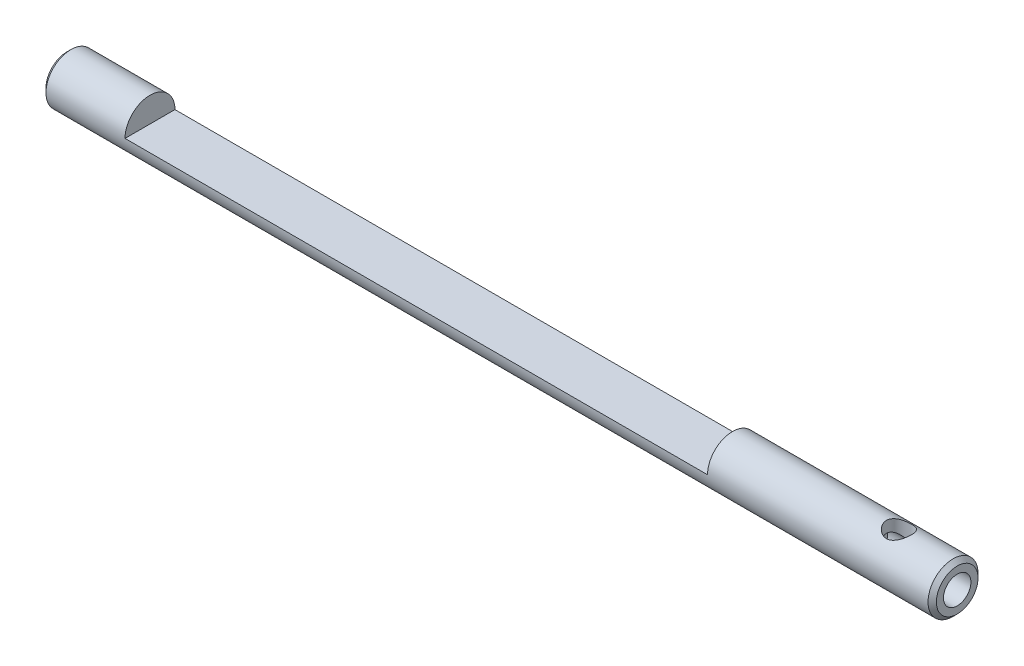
ISO-10303-21;
HEADER;
FILE_DESCRIPTION(('STEP AP214'),'2;1');
FILE_NAME('part.step','',(''),(''),'','','');
FILE_SCHEMA(('AUTOMOTIVE_DESIGN { 1 0 10303 214 1 1 1 1 }'));
ENDSEC;
DATA;
#1=APPLICATION_CONTEXT('core data for automotive mechanical design processes');
#2=APPLICATION_PROTOCOL_DEFINITION('international standard','automotive_design',2000,#1);
#3=PRODUCT_CONTEXT('',#1,'mechanical');
#4=PRODUCT('Part','Part','',(#3));
#5=PRODUCT_RELATED_PRODUCT_CATEGORY('part','',(#4));
#6=PRODUCT_DEFINITION_FORMATION('','',#4);
#7=PRODUCT_DEFINITION_CONTEXT('part definition',#1,'design');
#8=PRODUCT_DEFINITION('design','',#6,#7);
#9=PRODUCT_DEFINITION_SHAPE('','',#8);
#10=(LENGTH_UNIT() NAMED_UNIT(*) SI_UNIT(.MILLI.,.METRE.));
#11=(NAMED_UNIT(*) PLANE_ANGLE_UNIT() SI_UNIT($,.RADIAN.));
#12=(NAMED_UNIT(*) SI_UNIT($,.STERADIAN.) SOLID_ANGLE_UNIT());
#13=UNCERTAINTY_MEASURE_WITH_UNIT(LENGTH_MEASURE(1.E-05),#10,'distance_accuracy_value','');
#14=(GEOMETRIC_REPRESENTATION_CONTEXT(3) GLOBAL_UNCERTAINTY_ASSIGNED_CONTEXT((#13)) GLOBAL_UNIT_ASSIGNED_CONTEXT((#10,
#11,#12)) REPRESENTATION_CONTEXT('',''));
#15=CARTESIAN_POINT('',(0.,0.,0.));
#16=DIRECTION('',(0.,0.,1.));
#17=DIRECTION('',(1.,0.,0.));
#18=AXIS2_PLACEMENT_3D('',#15,#16,#17);
#19=CARTESIAN_POINT('',(17.,0.,0.));
#20=DIRECTION('',(1.,0.,0.));
#21=DIRECTION('',(0.,0.,-1.));
#22=AXIS2_PLACEMENT_3D('',#19,#20,#21);
#23=PLANE('',#22);
#24=CARTESIAN_POINT('',(17.,0.,0.));
#25=DIRECTION('',(1.,0.,0.));
#26=DIRECTION('',(0.,0.,-1.));
#27=AXIS2_PLACEMENT_3D('',#24,#25,#26);
#28=CIRCLE('',#27,1.65);
#29=CARTESIAN_POINT('',(17.,0.,-1.65));
#30=VERTEX_POINT('',#29);
#31=EDGE_CURVE('E131',#30,#30,#28,.T.);
#32=ORIENTED_EDGE('',*,*,#31,.T.);
#33=EDGE_LOOP('',(#32));
#34=FACE_BOUND('',#33,.T.);
#35=ADVANCED_FACE('F17',(#34),#23,.T.);
#36=CARTESIAN_POINT('',(27.,0.,0.));
#37=DIRECTION('',(1.,0.,0.));
#38=DIRECTION('',(0.,0.,-1.));
#39=AXIS2_PLACEMENT_3D('',#36,#37,#38);
#40=PLANE('',#39);
#41=CARTESIAN_POINT('',(27.,0.,0.));
#42=DIRECTION('',(1.,0.,0.));
#43=DIRECTION('',(0.,0.,-1.));
#44=AXIS2_PLACEMENT_3D('',#41,#42,#43);
#45=CIRCLE('',#44,1.65);
#46=CARTESIAN_POINT('',(27.,0.,-1.65));
#47=VERTEX_POINT('',#46);
#48=EDGE_CURVE('E127',#47,#47,#45,.F.);
#49=ORIENTED_EDGE('',*,*,#48,.T.);
#50=EDGE_LOOP('',(#49));
#51=FACE_BOUND('',#50,.T.);
#52=CARTESIAN_POINT('',(27.,0.,0.));
#53=DIRECTION('',(1.,0.,0.));
#54=DIRECTION('',(0.,0.,-1.));
#55=AXIS2_PLACEMENT_3D('',#52,#53,#54);
#56=CIRCLE('',#55,2.49988347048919);
#57=CARTESIAN_POINT('',(27.,0.,-2.49988347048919));
#58=VERTEX_POINT('',#57);
#59=EDGE_CURVE('E63',#58,#58,#56,.F.);
#60=ORIENTED_EDGE('',*,*,#59,.F.);
#61=EDGE_LOOP('',(#60));
#62=FACE_BOUND('',#61,.T.);
#63=ADVANCED_FACE('F148',(#51,#62),#40,.T.);
#64=CARTESIAN_POINT('',(20.,-3.600625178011,0.));
#65=DIRECTION('',(0.,1.,0.));
#66=DIRECTION('',(0.,0.,1.));
#67=AXIS2_PLACEMENT_3D('',#64,#65,#66);
#68=CYLINDRICAL_SURFACE('',#67,1.5);
#69=CARTESIAN_POINT('',(18.5,3.,0.));
#70=CARTESIAN_POINT('',(18.5000039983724,2.99999648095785,-0.078921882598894));
#71=CARTESIAN_POINT('',(18.5062604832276,2.9968547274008,-0.157888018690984));
#72=CARTESIAN_POINT('',(18.5309960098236,2.98460404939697,-0.31344088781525));
#73=CARTESIAN_POINT('',(18.5494874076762,2.97548909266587,-0.390025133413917));
#74=CARTESIAN_POINT('',(18.59778825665,2.95224539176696,-0.538394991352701));
#75=CARTESIAN_POINT('',(18.6275576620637,2.93813439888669,-0.610196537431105));
#76=CARTESIAN_POINT('',(18.6973480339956,2.90619015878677,-0.747695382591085));
#77=CARTESIAN_POINT('',(18.7373702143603,2.88835647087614,-0.813391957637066));
#78=CARTESIAN_POINT('',(18.8292767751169,2.84934349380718,-0.941263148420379));
#79=CARTESIAN_POINT('',(18.881731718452,2.82802717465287,-1.0029852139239));
#80=CARTESIAN_POINT('',(18.9957845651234,2.78489872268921,-1.11717112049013));
#81=CARTESIAN_POINT('',(19.057389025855,2.76308624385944,-1.16962826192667));
#82=CARTESIAN_POINT('',(19.1937248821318,2.7194843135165,-1.26787791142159));
#83=CARTESIAN_POINT('',(19.2691038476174,2.69782789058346,-1.31283782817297));
#84=CARTESIAN_POINT('',(19.4275506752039,2.65928974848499,-1.38925221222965));
#85=CARTESIAN_POINT('',(19.5106130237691,2.64240464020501,-1.42071627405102));
#86=CARTESIAN_POINT('',(19.6769975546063,2.61686802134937,-1.46719863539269));
#87=CARTESIAN_POINT('',(19.7600064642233,2.60778409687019,-1.48308874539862));
#88=CARTESIAN_POINT('',(19.9279680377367,2.59772835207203,-1.50064048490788));
#89=CARTESIAN_POINT('',(20.0129187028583,2.59674853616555,-1.50231613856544));
#90=CARTESIAN_POINT('',(20.171429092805,2.60266395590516,-1.49203092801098));
#91=CARTESIAN_POINT('',(20.2451361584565,2.6086314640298,-1.48167682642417));
#92=CARTESIAN_POINT('',(20.3895829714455,2.62614344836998,-1.45040973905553));
#93=CARTESIAN_POINT('',(20.4603217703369,2.63768969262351,-1.42949340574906));
#94=CARTESIAN_POINT('',(20.5988444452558,2.66531229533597,-1.37731440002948));
#95=CARTESIAN_POINT('',(20.6665210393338,2.68148795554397,-1.34582196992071));
#96=CARTESIAN_POINT('',(20.79595276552,2.71655146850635,-1.27356161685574));
#97=CARTESIAN_POINT('',(20.8577053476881,2.73544048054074,-1.23278972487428));
#98=CARTESIAN_POINT('',(20.9817757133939,2.77669532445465,-1.13710399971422));
#99=CARTESIAN_POINT('',(21.0431737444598,2.79919844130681,-1.08105287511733));
#100=CARTESIAN_POINT('',(21.1560935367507,2.84321031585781,-0.959344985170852));
#101=CARTESIAN_POINT('',(21.207608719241,2.86471840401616,-0.893681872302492));
#102=CARTESIAN_POINT('',(21.3015551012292,2.90554148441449,-0.750736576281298));
#103=CARTESIAN_POINT('',(21.3434466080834,2.9247062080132,-0.673053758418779));
#104=CARTESIAN_POINT('',(21.4131779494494,2.95738347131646,-0.510593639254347));
#105=CARTESIAN_POINT('',(21.4410445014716,2.97090674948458,-0.425830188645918));
#106=CARTESIAN_POINT('',(21.4740383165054,2.98708428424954,-0.283628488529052));
#107=CARTESIAN_POINT('',(21.4837494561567,2.99190265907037,-0.22746049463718));
#108=CARTESIAN_POINT('',(21.4967314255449,2.99836163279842,-0.114202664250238));
#109=CARTESIAN_POINT('',(21.5000028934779,3.00000254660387,-0.0571129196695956));
#110=CARTESIAN_POINT('',(21.4999960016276,2.99999648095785,0.0789218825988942));
#111=CARTESIAN_POINT('',(21.4937395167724,2.9968547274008,0.157888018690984));
#112=CARTESIAN_POINT('',(21.4690039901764,2.98460404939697,0.31344088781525));
#113=CARTESIAN_POINT('',(21.4505125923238,2.97548909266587,0.390025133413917));
#114=CARTESIAN_POINT('',(21.40221174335,2.95224539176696,0.5383949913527));
#115=CARTESIAN_POINT('',(21.3724423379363,2.93813439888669,0.610196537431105));
#116=CARTESIAN_POINT('',(21.3026519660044,2.90619015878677,0.747695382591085));
#117=CARTESIAN_POINT('',(21.2626297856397,2.88835647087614,0.813391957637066));
#118=CARTESIAN_POINT('',(21.1707232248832,2.84934349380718,0.941263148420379));
#119=CARTESIAN_POINT('',(21.118268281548,2.82802717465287,1.0029852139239));
#120=CARTESIAN_POINT('',(21.0042154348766,2.78489872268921,1.11717112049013));
#121=CARTESIAN_POINT('',(20.942610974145,2.76308624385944,1.16962826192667));
#122=CARTESIAN_POINT('',(20.8062751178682,2.7194843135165,1.26787791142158));
#123=CARTESIAN_POINT('',(20.7308961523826,2.69782789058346,1.31283782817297));
#124=CARTESIAN_POINT('',(20.5724493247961,2.65928974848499,1.38925221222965));
#125=CARTESIAN_POINT('',(20.4893869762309,2.64240464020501,1.42071627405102));
#126=CARTESIAN_POINT('',(20.3230024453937,2.61686802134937,1.46719863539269));
#127=CARTESIAN_POINT('',(20.2399935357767,2.60778409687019,1.48308874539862));
#128=CARTESIAN_POINT('',(20.0720319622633,2.59772835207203,1.50064048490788));
#129=CARTESIAN_POINT('',(19.9870812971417,2.59674853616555,1.50231613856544));
#130=CARTESIAN_POINT('',(19.828570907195,2.60266395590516,1.49203092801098));
#131=CARTESIAN_POINT('',(19.7548638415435,2.6086314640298,1.48167682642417));
#132=CARTESIAN_POINT('',(19.6104170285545,2.62614344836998,1.45040973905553));
#133=CARTESIAN_POINT('',(19.5396782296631,2.63768969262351,1.42949340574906));
#134=CARTESIAN_POINT('',(19.4011555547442,2.66531229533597,1.37731440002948));
#135=CARTESIAN_POINT('',(19.3334789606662,2.68148795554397,1.34582196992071));
#136=CARTESIAN_POINT('',(19.20404723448,2.71655146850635,1.27356161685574));
#137=CARTESIAN_POINT('',(19.1422946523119,2.73544048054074,1.23278972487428));
#138=CARTESIAN_POINT('',(19.0182242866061,2.77669532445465,1.13710399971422));
#139=CARTESIAN_POINT('',(18.9568262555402,2.79919844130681,1.08105287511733));
#140=CARTESIAN_POINT('',(18.8439064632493,2.84321031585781,0.959344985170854));
#141=CARTESIAN_POINT('',(18.792391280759,2.86471840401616,0.893681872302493));
#142=CARTESIAN_POINT('',(18.6984448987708,2.90554148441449,0.750736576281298));
#143=CARTESIAN_POINT('',(18.6565533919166,2.9247062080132,0.67305375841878));
#144=CARTESIAN_POINT('',(18.5868220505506,2.95738347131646,0.510593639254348));
#145=CARTESIAN_POINT('',(18.5589554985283,2.97090674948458,0.42583018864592));
#146=CARTESIAN_POINT('',(18.5259616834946,2.98708428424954,0.283628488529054));
#147=CARTESIAN_POINT('',(18.5162505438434,2.99190265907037,0.227460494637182));
#148=CARTESIAN_POINT('',(18.5032685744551,2.99836163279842,0.114202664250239));
#149=CARTESIAN_POINT('',(18.4999971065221,3.00000254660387,0.0571129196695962));
#150=CARTESIAN_POINT('',(18.5,3.,0.));
#151=B_SPLINE_CURVE_WITH_KNOTS('',3,(#69,#70,#71,#72,#73,#74,#75,#76,#77,#78,#79,#80,#81,#82,
#83,#84,#85,#86,#87,#88,#89,#90,#91,#92,#93,#94,#95,#96,#97,#98,#99,#100,#101,#102,#103,#104,
#105,#106,#107,#108,#109,#110,#111,#112,#113,#114,#115,#116,#117,#118,#119,#120,#121,#122,#123,
#124,#125,#126,#127,#128,#129,#130,#131,#132,#133,#134,#135,#136,#137,#138,#139,#140,#141,#142,
#143,#144,#145,#146,#147,#148,#149,#150),.UNSPECIFIED.,.T.,.F.,(4,2,2,2,2,2,2,2,2,2,2,2,2,2,2,2,
2,2,2,2,2,2,2,2,2,2,2,2,2,2,2,2,2,2,2,2,2,2,2,2,4),(0.,0.23654148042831,0.473322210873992,
0.709269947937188,0.945245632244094,1.19547738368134,1.4458893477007,1.71572535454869,
1.98536920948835,2.23886984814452,2.49212035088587,2.71508584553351,2.93812204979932,
3.16635602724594,3.39468780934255,3.65195007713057,3.90938300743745,4.17889584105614,
4.44789329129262,4.61908679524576,4.79026333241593,5.02680481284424,5.26358554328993,
5.49953328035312,5.73550896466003,5.98574071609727,6.23615268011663,6.50598868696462,
6.77563254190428,7.02913318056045,7.2823836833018,7.50534917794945,7.72838538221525,
7.95661935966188,8.18495114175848,8.4422134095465,8.69964633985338,8.96915917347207,
9.23815662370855,9.4093501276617,9.58052666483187),.UNSPECIFIED.);
#152=CARTESIAN_POINT('',(18.5,3.,0.));
#153=VERTEX_POINT('',#152);
#154=EDGE_CURVE('E62',#153,#153,#151,.T.);
#155=ORIENTED_EDGE('',*,*,#154,.F.);
#156=EDGE_LOOP('',(#155));
#157=FACE_BOUND('',#156,.T.);
#158=CARTESIAN_POINT('',(21.5,1.65,0.));
#159=CARTESIAN_POINT('',(21.4999954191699,1.64999547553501,-0.0692818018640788));
#160=CARTESIAN_POINT('',(21.4951613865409,1.64559748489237,-0.138601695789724));
#161=CARTESIAN_POINT('',(21.4762048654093,1.62839356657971,-0.274898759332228));
#162=CARTESIAN_POINT('',(21.4620729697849,1.61557912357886,-0.341873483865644));
#163=CARTESIAN_POINT('',(21.4256586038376,1.58270067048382,-0.471149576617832));
#164=CARTESIAN_POINT('',(21.4034288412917,1.56268355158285,-0.533478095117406));
#165=CARTESIAN_POINT('',(21.352056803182,1.5167159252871,-0.652818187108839));
#166=CARTESIAN_POINT('',(21.322911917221,1.49076317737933,-0.709827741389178));
#167=CARTESIAN_POINT('',(21.2461003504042,1.42296017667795,-0.839625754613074));
#168=CARTESIAN_POINT('',(21.1956838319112,1.37889899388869,-0.909631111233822));
#169=CARTESIAN_POINT('',(21.0861021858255,1.28503558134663,-1.0380476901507));
#170=CARTESIAN_POINT('',(21.0269159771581,1.23521958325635,-1.09643015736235));
#171=CARTESIAN_POINT('',(20.8997469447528,1.13164064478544,-1.20312945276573));
#172=CARTESIAN_POINT('',(20.83158694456,1.07781163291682,-1.25117075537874));
#173=CARTESIAN_POINT('',(20.7238007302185,0.997909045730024,-1.3144726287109));
#174=CARTESIAN_POINT('',(20.6869687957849,0.971428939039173,-1.33410507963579));
#175=CARTESIAN_POINT('',(20.6112501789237,0.919436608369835,-1.37045172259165));
#176=CARTESIAN_POINT('',(20.5723647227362,0.893923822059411,-1.38716763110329));
#177=CARTESIAN_POINT('',(20.4927929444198,0.845202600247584,-1.41737145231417));
#178=CARTESIAN_POINT('',(20.4521396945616,0.821966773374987,-1.43090150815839));
#179=CARTESIAN_POINT('',(20.3681192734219,0.778915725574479,-1.45478302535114));
#180=CARTESIAN_POINT('',(20.3247534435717,0.759098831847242,-1.46513604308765));
#181=CARTESIAN_POINT('',(20.2426535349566,0.728146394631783,-1.48072726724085));
#182=CARTESIAN_POINT('',(20.204381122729,0.716108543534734,-1.48653512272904));
#183=CARTESIAN_POINT('',(20.1261938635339,0.697850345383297,-1.49519595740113));
#184=CARTESIAN_POINT('',(20.0862846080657,0.691611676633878,-1.49805824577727));
#185=CARTESIAN_POINT('',(20.0055274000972,0.686223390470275,-1.50053652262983));
#186=CARTESIAN_POINT('',(19.9646744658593,0.687131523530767,-1.50012606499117));
#187=CARTESIAN_POINT('',(19.8838714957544,0.69595859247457,-1.49604844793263));
#188=CARTESIAN_POINT('',(19.8439236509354,0.70389299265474,-1.4923741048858));
#189=CARTESIAN_POINT('',(19.7522978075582,0.728886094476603,-1.48036142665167));
#190=CARTESIAN_POINT('',(19.7014116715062,0.74816717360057,-1.47084031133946));
#191=CARTESIAN_POINT('',(19.6032194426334,0.792461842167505,-1.44745752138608));
#192=CARTESIAN_POINT('',(19.5559287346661,0.817498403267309,-1.43357836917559));
#193=CARTESIAN_POINT('',(19.4659831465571,0.869704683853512,-1.40250106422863));
#194=CARTESIAN_POINT('',(19.4232267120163,0.896776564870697,-1.38542775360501));
#195=CARTESIAN_POINT('',(19.3401823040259,0.952319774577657,-1.34785648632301));
#196=CARTESIAN_POINT('',(19.2998963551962,0.980792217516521,-1.32735577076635));
#197=CARTESIAN_POINT('',(19.18227493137,1.06690097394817,-1.26074195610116));
#198=CARTESIAN_POINT('',(19.1082257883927,1.12519685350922,-1.20953484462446));
#199=CARTESIAN_POINT('',(18.9649433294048,1.24180087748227,-1.08988887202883));
#200=CARTESIAN_POINT('',(18.8962372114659,1.29991424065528,-1.02062385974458));
#201=CARTESIAN_POINT('',(18.7713113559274,1.4075439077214,-0.866085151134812));
#202=CARTESIAN_POINT('',(18.7150438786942,1.45709291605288,-0.780875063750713));
#203=CARTESIAN_POINT('',(18.6374334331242,1.5260763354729,-0.630570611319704));
#204=CARTESIAN_POINT('',(18.610935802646,1.54980747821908,-0.570088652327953));
#205=CARTESIAN_POINT('',(18.5657112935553,1.5904666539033,-0.444149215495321));
#206=CARTESIAN_POINT('',(18.5469714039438,1.60740607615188,-0.378700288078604));
#207=CARTESIAN_POINT('',(18.5219674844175,1.63004916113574,-0.260959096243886));
#208=CARTESIAN_POINT('',(18.513765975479,1.63749392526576,-0.209405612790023));
#209=CARTESIAN_POINT('',(18.5027801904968,1.64747133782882,-0.105242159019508));
#210=CARTESIAN_POINT('',(18.4999965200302,1.65000343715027,-0.0526320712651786));
#211=CARTESIAN_POINT('',(18.5000045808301,1.64999547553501,0.0692818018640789));
#212=CARTESIAN_POINT('',(18.5048386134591,1.64559748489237,0.138601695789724));
#213=CARTESIAN_POINT('',(18.5237951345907,1.62839356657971,0.274898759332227));
#214=CARTESIAN_POINT('',(18.5379270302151,1.61557912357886,0.341873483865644));
#215=CARTESIAN_POINT('',(18.5743413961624,1.58270067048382,0.471149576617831));
#216=CARTESIAN_POINT('',(18.5965711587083,1.56268355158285,0.533478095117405));
#217=CARTESIAN_POINT('',(18.647943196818,1.5167159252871,0.652818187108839));
#218=CARTESIAN_POINT('',(18.677088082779,1.49076317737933,0.709827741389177));
#219=CARTESIAN_POINT('',(18.7538996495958,1.42296017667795,0.839625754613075));
#220=CARTESIAN_POINT('',(18.8043161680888,1.37889899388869,0.909631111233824));
#221=CARTESIAN_POINT('',(18.9138978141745,1.28503558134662,1.0380476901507));
#222=CARTESIAN_POINT('',(18.973084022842,1.23521958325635,1.09643015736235));
#223=CARTESIAN_POINT('',(19.1002530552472,1.13164064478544,1.20312945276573));
#224=CARTESIAN_POINT('',(19.16841305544,1.07781163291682,1.25117075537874));
#225=CARTESIAN_POINT('',(19.2761992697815,0.997909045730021,1.3144726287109));
#226=CARTESIAN_POINT('',(19.3130312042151,0.971428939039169,1.33410507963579));
#227=CARTESIAN_POINT('',(19.3887498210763,0.919436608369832,1.37045172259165));
#228=CARTESIAN_POINT('',(19.4276352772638,0.893923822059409,1.38716763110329));
#229=CARTESIAN_POINT('',(19.5072070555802,0.845202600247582,1.41737145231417));
#230=CARTESIAN_POINT('',(19.5478603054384,0.821966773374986,1.43090150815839));
#231=CARTESIAN_POINT('',(19.6318807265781,0.778915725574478,1.45478302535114));
#232=CARTESIAN_POINT('',(19.6752465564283,0.759098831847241,1.46513604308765));
#233=CARTESIAN_POINT('',(19.7573464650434,0.728146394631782,1.48072726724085));
#234=CARTESIAN_POINT('',(19.795618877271,0.716108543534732,1.48653512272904));
#235=CARTESIAN_POINT('',(19.8738061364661,0.697850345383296,1.49519595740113));
#236=CARTESIAN_POINT('',(19.9137153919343,0.691611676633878,1.49805824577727));
#237=CARTESIAN_POINT('',(19.9944725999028,0.686223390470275,1.50053652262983));
#238=CARTESIAN_POINT('',(20.0353255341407,0.687131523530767,1.50012606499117));
#239=CARTESIAN_POINT('',(20.1161285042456,0.69595859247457,1.49604844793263));
#240=CARTESIAN_POINT('',(20.1560763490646,0.70389299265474,1.4923741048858));
#241=CARTESIAN_POINT('',(20.2477021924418,0.728886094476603,1.48036142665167));
#242=CARTESIAN_POINT('',(20.2985883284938,0.748167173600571,1.47084031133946));
#243=CARTESIAN_POINT('',(20.3967805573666,0.792461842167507,1.44745752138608));
#244=CARTESIAN_POINT('',(20.4440712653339,0.817498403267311,1.43357836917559));
#245=CARTESIAN_POINT('',(20.5340168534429,0.869704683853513,1.40250106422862));
#246=CARTESIAN_POINT('',(20.5767732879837,0.896776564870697,1.38542775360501));
#247=CARTESIAN_POINT('',(20.6598176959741,0.952319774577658,1.34785648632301));
#248=CARTESIAN_POINT('',(20.7001036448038,0.980792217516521,1.32735577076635));
#249=CARTESIAN_POINT('',(20.81772506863,1.06690097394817,1.26074195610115));
#250=CARTESIAN_POINT('',(20.8917742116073,1.12519685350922,1.20953484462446));
#251=CARTESIAN_POINT('',(21.0350566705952,1.24180087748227,1.08988887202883));
#252=CARTESIAN_POINT('',(21.1037627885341,1.29991424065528,1.02062385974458));
#253=CARTESIAN_POINT('',(21.2286886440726,1.4075439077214,0.866085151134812));
#254=CARTESIAN_POINT('',(21.2849561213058,1.45709291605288,0.780875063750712));
#255=CARTESIAN_POINT('',(21.3625665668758,1.5260763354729,0.630570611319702));
#256=CARTESIAN_POINT('',(21.389064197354,1.54980747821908,0.570088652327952));
#257=CARTESIAN_POINT('',(21.4342887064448,1.5904666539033,0.44414921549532));
#258=CARTESIAN_POINT('',(21.4530285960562,1.60740607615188,0.378700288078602));
#259=CARTESIAN_POINT('',(21.4780325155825,1.63004916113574,0.260959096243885));
#260=CARTESIAN_POINT('',(21.486234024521,1.63749392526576,0.209405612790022));
#261=CARTESIAN_POINT('',(21.4972198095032,1.64747133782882,0.105242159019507));
#262=CARTESIAN_POINT('',(21.5000034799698,1.65000343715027,0.0526320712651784));
#263=CARTESIAN_POINT('',(21.5,1.65,0.));
#264=B_SPLINE_CURVE_WITH_KNOTS('',3,(#158,#159,#160,#161,#162,#163,#164,#165,#166,#167,#168,
#169,#170,#171,#172,#173,#174,#175,#176,#177,#178,#179,#180,#181,#182,#183,#184,#185,#186,#187,
#188,#189,#190,#191,#192,#193,#194,#195,#196,#197,#198,#199,#200,#201,#202,#203,#204,#205,#206,
#207,#208,#209,#210,#211,#212,#213,#214,#215,#216,#217,#218,#219,#220,#221,#222,#223,#224,#225,
#226,#227,#228,#229,#230,#231,#232,#233,#234,#235,#236,#237,#238,#239,#240,#241,#242,#243,#244,
#245,#246,#247,#248,#249,#250,#251,#252,#253,#254,#255,#256,#257,#258,#259,#260,#261,#262,#263),
.UNSPECIFIED.,.T.,.F.,(4,2,2,2,2,2,2,2,2,2,2,2,2,2,2,2,2,2,2,2,2,2,2,2,2,2,2,2,2,2,2,2,2,2,2,2,
2,2,2,2,2,2,2,2,2,2,2,2,2,2,2,2,4),(0.,0.207617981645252,0.415446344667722,0.621945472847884,
0.828522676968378,1.11754439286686,1.40727249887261,1.70396132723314,1.852147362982,
2.00024589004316,2.1462588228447,2.29220011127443,2.41339222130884,2.53420012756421,
2.65598523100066,2.778039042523,2.9428402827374,3.10831107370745,3.2683134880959,
3.42844532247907,3.74889242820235,4.08789625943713,4.42557548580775,4.63530008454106,
4.84467150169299,5.00237731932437,5.16010076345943,5.36771874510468,5.57554710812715,
5.78204623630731,5.98862344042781,6.27764515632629,6.56737326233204,6.86406209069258,
7.01224812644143,7.16034665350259,7.30635958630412,7.45230087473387,7.57349298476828,
7.69430089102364,7.81608599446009,7.93813980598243,8.10294104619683,8.26841183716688,
8.42841425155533,8.5885460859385,8.90899319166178,9.24799702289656,9.58567624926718,
9.79540084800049,10.0047722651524,10.1624780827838,10.3202015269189),.UNSPECIFIED.);
#265=CARTESIAN_POINT('',(21.5,1.65,0.));
#266=VERTEX_POINT('',#265);
#267=EDGE_CURVE('E22',#266,#266,#264,.T.);
#268=ORIENTED_EDGE('',*,*,#267,.F.);
#269=EDGE_LOOP('',(#268));
#270=FACE_BOUND('',#269,.T.);
#271=ADVANCED_FACE('F142',(#157,#270),#68,.F.);
#272=CARTESIAN_POINT('',(-80.,0.,0.));
#273=DIRECTION('',(1.,0.,0.));
#274=DIRECTION('',(0.,0.,-1.));
#275=AXIS2_PLACEMENT_3D('',#272,#273,#274);
#276=PLANE('',#275);
#277=CARTESIAN_POINT('',(-80.,0.,0.));
#278=DIRECTION('',(1.,0.,0.));
#279=DIRECTION('',(0.,0.,-1.));
#280=AXIS2_PLACEMENT_3D('',#277,#278,#279);
#281=CIRCLE('',#280,2.49988347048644);
#282=CARTESIAN_POINT('',(-80.,0.,-2.49988347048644));
#283=VERTEX_POINT('',#282);
#284=EDGE_CURVE('E141',#283,#283,#281,.T.);
#285=ORIENTED_EDGE('',*,*,#284,.F.);
#286=EDGE_LOOP('',(#285));
#287=FACE_BOUND('',#286,.T.);
#288=ADVANCED_FACE('F147',(#287),#276,.F.);
#289=CARTESIAN_POINT('',(0.,0.,0.));
#290=DIRECTION('',(1.,0.,0.));
#291=DIRECTION('',(0.,0.,-1.));
#292=AXIS2_PLACEMENT_3D('',#289,#290,#291);
#293=PLANE('',#292);
#294=CARTESIAN_POINT('',(0.,0.,0.));
#295=DIRECTION('',(1.,0.,0.));
#296=DIRECTION('',(0.,0.,-1.));
#297=AXIS2_PLACEMENT_3D('',#294,#295,#296);
#298=CIRCLE('',#297,3.);
#299=CARTESIAN_POINT('',(0.,0.,-3.));
#300=VERTEX_POINT('',#299);
#301=CARTESIAN_POINT('',(0.,9.93800260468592E-09,3.));
#302=VERTEX_POINT('',#301);
#303=EDGE_CURVE('E48',#300,#302,#298,.T.);
#304=ORIENTED_EDGE('',*,*,#303,.F.);
#305=DIRECTION('',(0.,0.,-1.));
#306=VECTOR('',#305,1.);
#307=CARTESIAN_POINT('',(0.,0.,3.));
#308=LINE('',#307,#306);
#309=EDGE_CURVE('E50',#300,#302,#308,.F.);
#310=ORIENTED_EDGE('',*,*,#309,.T.);
#311=EDGE_LOOP('',(#304,#310));
#312=FACE_BOUND('',#311,.T.);
#313=ADVANCED_FACE('F51',(#312),#293,.F.);
#314=CARTESIAN_POINT('',(-70.,0.,0.));
#315=DIRECTION('',(1.,0.,0.));
#316=DIRECTION('',(0.,0.,-1.));
#317=AXIS2_PLACEMENT_3D('',#314,#315,#316);
#318=PLANE('',#317);
#319=DIRECTION('',(0.,0.,-1.));
#320=VECTOR('',#319,1.);
#321=CARTESIAN_POINT('',(-70.,0.,3.));
#322=LINE('',#321,#320);
#323=CARTESIAN_POINT('',(-70.,0.,3.));
#324=VERTEX_POINT('',#323);
#325=CARTESIAN_POINT('',(-70.,0.,-3.));
#326=VERTEX_POINT('',#325);
#327=EDGE_CURVE('E40',#324,#326,#322,.T.);
#328=ORIENTED_EDGE('',*,*,#327,.T.);
#329=CARTESIAN_POINT('',(-70.,0.,0.));
#330=DIRECTION('',(1.,0.,0.));
#331=DIRECTION('',(0.,0.,-1.));
#332=AXIS2_PLACEMENT_3D('',#329,#330,#331);
#333=CIRCLE('',#332,3.);
#334=EDGE_CURVE('E56',#324,#326,#333,.F.);
#335=ORIENTED_EDGE('',*,*,#334,.F.);
#336=EDGE_LOOP('',(#328,#335));
#337=FACE_BOUND('',#336,.T.);
#338=ADVANCED_FACE('F97',(#337),#318,.T.);
#339=CARTESIAN_POINT('',(27.,0.,0.));
#340=DIRECTION('',(1.,0.,0.));
#341=DIRECTION('',(0.,0.,-1.));
#342=AXIS2_PLACEMENT_3D('',#339,#340,#341);
#343=CYLINDRICAL_SURFACE('',#342,1.65);
#344=ORIENTED_EDGE('',*,*,#31,.F.);
#345=EDGE_LOOP('',(#344));
#346=FACE_BOUND('',#345,.T.);
#347=CARTESIAN_POINT('',(18.5,-1.65,0.));
#348=CARTESIAN_POINT('',(18.5000045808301,-1.64999547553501,-0.0692818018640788));
#349=CARTESIAN_POINT('',(18.5048386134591,-1.64559748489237,-0.138601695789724));
#350=CARTESIAN_POINT('',(18.5237951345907,-1.62839356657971,-0.274898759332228));
#351=CARTESIAN_POINT('',(18.5379270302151,-1.61557912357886,-0.341873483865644));
#352=CARTESIAN_POINT('',(18.5743413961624,-1.58270067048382,-0.471149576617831));
#353=CARTESIAN_POINT('',(18.5965711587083,-1.56268355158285,-0.533478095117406));
#354=CARTESIAN_POINT('',(18.647943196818,-1.5167159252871,-0.652818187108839));
#355=CARTESIAN_POINT('',(18.677088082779,-1.49076317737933,-0.709827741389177));
#356=CARTESIAN_POINT('',(18.7538996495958,-1.42296017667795,-0.839625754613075));
#357=CARTESIAN_POINT('',(18.8043161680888,-1.37889899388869,-0.909631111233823));
#358=CARTESIAN_POINT('',(18.9138978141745,-1.28503558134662,-1.0380476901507));
#359=CARTESIAN_POINT('',(18.973084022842,-1.23521958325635,-1.09643015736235));
#360=CARTESIAN_POINT('',(19.1002530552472,-1.13164064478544,-1.20312945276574));
#361=CARTESIAN_POINT('',(19.16841305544,-1.07781163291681,-1.25117075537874));
#362=CARTESIAN_POINT('',(19.2761992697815,-0.997909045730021,-1.3144726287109));
#363=CARTESIAN_POINT('',(19.3130312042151,-0.97142893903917,-1.33410507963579));
#364=CARTESIAN_POINT('',(19.3887498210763,-0.919436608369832,-1.37045172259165));
#365=CARTESIAN_POINT('',(19.4276352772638,-0.893923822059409,-1.38716763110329));
#366=CARTESIAN_POINT('',(19.5072070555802,-0.845202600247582,-1.41737145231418));
#367=CARTESIAN_POINT('',(19.5478603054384,-0.821966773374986,-1.43090150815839));
#368=CARTESIAN_POINT('',(19.6318807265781,-0.778915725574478,-1.45478302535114));
#369=CARTESIAN_POINT('',(19.6752465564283,-0.759098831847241,-1.46513604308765));
#370=CARTESIAN_POINT('',(19.7573464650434,-0.728146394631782,-1.48072726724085));
#371=CARTESIAN_POINT('',(19.795618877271,-0.716108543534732,-1.48653512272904));
#372=CARTESIAN_POINT('',(19.8738061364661,-0.697850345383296,-1.49519595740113));
#373=CARTESIAN_POINT('',(19.9137153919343,-0.691611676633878,-1.49805824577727));
#374=CARTESIAN_POINT('',(19.9944725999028,-0.686223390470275,-1.50053652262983));
#375=CARTESIAN_POINT('',(20.0353255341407,-0.687131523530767,-1.50012606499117));
#376=CARTESIAN_POINT('',(20.1161285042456,-0.69595859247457,-1.49604844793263));
#377=CARTESIAN_POINT('',(20.1560763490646,-0.70389299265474,-1.4923741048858));
#378=CARTESIAN_POINT('',(20.2477021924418,-0.728886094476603,-1.48036142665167));
#379=CARTESIAN_POINT('',(20.2985883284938,-0.748167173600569,-1.47084031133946));
#380=CARTESIAN_POINT('',(20.3967805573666,-0.792461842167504,-1.44745752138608));
#381=CARTESIAN_POINT('',(20.4440712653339,-0.817498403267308,-1.43357836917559));
#382=CARTESIAN_POINT('',(20.5340168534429,-0.869704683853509,-1.40250106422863));
#383=CARTESIAN_POINT('',(20.5767732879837,-0.896776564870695,-1.38542775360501));
#384=CARTESIAN_POINT('',(20.6598176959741,-0.952319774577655,-1.34785648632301));
#385=CARTESIAN_POINT('',(20.7001036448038,-0.980792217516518,-1.32735577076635));
#386=CARTESIAN_POINT('',(20.81772506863,-1.06690097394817,-1.26074195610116));
#387=CARTESIAN_POINT('',(20.8917742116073,-1.12519685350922,-1.20953484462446));
#388=CARTESIAN_POINT('',(21.0350566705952,-1.24180087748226,-1.08988887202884));
#389=CARTESIAN_POINT('',(21.1037627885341,-1.29991424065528,-1.02062385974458));
#390=CARTESIAN_POINT('',(21.2286886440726,-1.4075439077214,-0.866085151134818));
#391=CARTESIAN_POINT('',(21.2849561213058,-1.45709291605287,-0.78087506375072));
#392=CARTESIAN_POINT('',(21.3625665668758,-1.52607633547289,-0.630570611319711));
#393=CARTESIAN_POINT('',(21.389064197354,-1.54980747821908,-0.570088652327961));
#394=CARTESIAN_POINT('',(21.4342887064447,-1.59046665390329,-0.444149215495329));
#395=CARTESIAN_POINT('',(21.4530285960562,-1.60740607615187,-0.378700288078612));
#396=CARTESIAN_POINT('',(21.4780325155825,-1.63004916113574,-0.260959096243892));
#397=CARTESIAN_POINT('',(21.486234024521,-1.63749392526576,-0.209405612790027));
#398=CARTESIAN_POINT('',(21.4972198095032,-1.64747133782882,-0.10524215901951));
#399=CARTESIAN_POINT('',(21.5000034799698,-1.65000343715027,-0.0526320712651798));
#400=CARTESIAN_POINT('',(21.4999954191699,-1.64999547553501,0.0692818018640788));
#401=CARTESIAN_POINT('',(21.4951613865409,-1.64559748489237,0.138601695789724));
#402=CARTESIAN_POINT('',(21.4762048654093,-1.62839356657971,0.274898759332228));
#403=CARTESIAN_POINT('',(21.4620729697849,-1.61557912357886,0.341873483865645));
#404=CARTESIAN_POINT('',(21.4256586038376,-1.58270067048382,0.471149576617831));
#405=CARTESIAN_POINT('',(21.4034288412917,-1.56268355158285,0.533478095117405));
#406=CARTESIAN_POINT('',(21.352056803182,-1.5167159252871,0.652818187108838));
#407=CARTESIAN_POINT('',(21.322911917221,-1.49076317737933,0.709827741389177));
#408=CARTESIAN_POINT('',(21.2461003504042,-1.42296017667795,0.839625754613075));
#409=CARTESIAN_POINT('',(21.1956838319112,-1.37889899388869,0.909631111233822));
#410=CARTESIAN_POINT('',(21.0861021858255,-1.28503558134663,1.0380476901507));
#411=CARTESIAN_POINT('',(21.0269159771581,-1.23521958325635,1.09643015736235));
#412=CARTESIAN_POINT('',(20.8997469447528,-1.13164064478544,1.20312945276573));
#413=CARTESIAN_POINT('',(20.83158694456,-1.07781163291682,1.25117075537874));
#414=CARTESIAN_POINT('',(20.7238007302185,-0.997909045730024,1.3144726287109));
#415=CARTESIAN_POINT('',(20.6869687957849,-0.971428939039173,1.33410507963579));
#416=CARTESIAN_POINT('',(20.6112501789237,-0.919436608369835,1.37045172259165));
#417=CARTESIAN_POINT('',(20.5723647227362,-0.893923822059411,1.38716763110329));
#418=CARTESIAN_POINT('',(20.4927929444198,-0.845202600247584,1.41737145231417));
#419=CARTESIAN_POINT('',(20.4521396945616,-0.821966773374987,1.43090150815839));
#420=CARTESIAN_POINT('',(20.3681192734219,-0.778915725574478,1.45478302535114));
#421=CARTESIAN_POINT('',(20.3247534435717,-0.759098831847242,1.46513604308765));
#422=CARTESIAN_POINT('',(20.2426535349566,-0.728146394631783,1.48072726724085));
#423=CARTESIAN_POINT('',(20.204381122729,-0.716108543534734,1.48653512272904));
#424=CARTESIAN_POINT('',(20.1261938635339,-0.697850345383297,1.49519595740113));
#425=CARTESIAN_POINT('',(20.0862846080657,-0.691611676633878,1.49805824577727));
#426=CARTESIAN_POINT('',(20.0055274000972,-0.686223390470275,1.50053652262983));
#427=CARTESIAN_POINT('',(19.9646744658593,-0.687131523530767,1.50012606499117));
#428=CARTESIAN_POINT('',(19.8838714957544,-0.69595859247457,1.49604844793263));
#429=CARTESIAN_POINT('',(19.8439236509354,-0.70389299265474,1.4923741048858));
#430=CARTESIAN_POINT('',(19.7522978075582,-0.728886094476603,1.48036142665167));
#431=CARTESIAN_POINT('',(19.7014116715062,-0.74816717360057,1.47084031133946));
#432=CARTESIAN_POINT('',(19.6032194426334,-0.792461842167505,1.44745752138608));
#433=CARTESIAN_POINT('',(19.5559287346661,-0.81749840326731,1.43357836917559));
#434=CARTESIAN_POINT('',(19.4659831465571,-0.869704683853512,1.40250106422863));
#435=CARTESIAN_POINT('',(19.4232267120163,-0.896776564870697,1.38542775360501));
#436=CARTESIAN_POINT('',(19.3401823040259,-0.952319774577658,1.34785648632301));
#437=CARTESIAN_POINT('',(19.2998963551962,-0.980792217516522,1.32735577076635));
#438=CARTESIAN_POINT('',(19.18227493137,-1.06690097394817,1.26074195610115));
#439=CARTESIAN_POINT('',(19.1082257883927,-1.12519685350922,1.20953484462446));
#440=CARTESIAN_POINT('',(18.9649433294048,-1.24180087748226,1.08988887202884));
#441=CARTESIAN_POINT('',(18.8962372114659,-1.29991424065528,1.02062385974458));
#442=CARTESIAN_POINT('',(18.7713113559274,-1.4075439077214,0.866085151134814));
#443=CARTESIAN_POINT('',(18.7150438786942,-1.45709291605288,0.780875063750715));
#444=CARTESIAN_POINT('',(18.6374334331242,-1.52607633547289,0.630570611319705));
#445=CARTESIAN_POINT('',(18.610935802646,-1.54980747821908,0.570088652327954));
#446=CARTESIAN_POINT('',(18.5657112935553,-1.5904666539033,0.444149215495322));
#447=CARTESIAN_POINT('',(18.5469714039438,-1.60740607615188,0.378700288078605));
#448=CARTESIAN_POINT('',(18.5219674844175,-1.63004916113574,0.260959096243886));
#449=CARTESIAN_POINT('',(18.513765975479,-1.63749392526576,0.209405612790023));
#450=CARTESIAN_POINT('',(18.5027801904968,-1.64747133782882,0.105242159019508));
#451=CARTESIAN_POINT('',(18.4999965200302,-1.65000343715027,0.0526320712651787));
#452=CARTESIAN_POINT('',(18.5,-1.65,0.));
#453=B_SPLINE_CURVE_WITH_KNOTS('',3,(#347,#348,#349,#350,#351,#352,#353,#354,#355,#356,#357,
#358,#359,#360,#361,#362,#363,#364,#365,#366,#367,#368,#369,#370,#371,#372,#373,#374,#375,#376,
#377,#378,#379,#380,#381,#382,#383,#384,#385,#386,#387,#388,#389,#390,#391,#392,#393,#394,#395,
#396,#397,#398,#399,#400,#401,#402,#403,#404,#405,#406,#407,#408,#409,#410,#411,#412,#413,#414,
#415,#416,#417,#418,#419,#420,#421,#422,#423,#424,#425,#426,#427,#428,#429,#430,#431,#432,#433,
#434,#435,#436,#437,#438,#439,#440,#441,#442,#443,#444,#445,#446,#447,#448,#449,#450,#451,#452),
.UNSPECIFIED.,.T.,.F.,(4,2,2,2,2,2,2,2,2,2,2,2,2,2,2,2,2,2,2,2,2,2,2,2,2,2,2,2,2,2,2,2,2,2,2,2,
2,2,2,2,2,2,2,2,2,2,2,2,2,2,2,2,4),(0.,0.207617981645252,0.415446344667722,0.621945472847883,
0.828522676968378,1.11754439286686,1.40727249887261,1.70396132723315,1.85214736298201,
2.00024589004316,2.1462588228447,2.29220011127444,2.41339222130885,2.53420012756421,
2.65598523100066,2.77803904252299,2.9428402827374,3.10831107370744,3.26831348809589,
3.42844532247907,3.74889242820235,4.08789625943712,4.42557548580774,4.63530008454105,
4.84467150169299,5.00237731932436,5.16010076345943,5.36771874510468,5.57554710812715,
5.78204623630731,5.98862344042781,6.27764515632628,6.56737326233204,6.86406209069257,
7.01224812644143,7.16034665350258,7.30635958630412,7.45230087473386,7.57349298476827,
7.69430089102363,7.81608599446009,7.93813980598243,8.10294104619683,8.26841183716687,
8.42841425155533,8.5885460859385,8.90899319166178,9.24799702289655,9.58567624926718,
9.79540084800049,10.0047722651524,10.1624780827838,10.3202015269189),.UNSPECIFIED.);
#454=CARTESIAN_POINT('',(18.5,-1.65,0.));
#455=VERTEX_POINT('',#454);
#456=EDGE_CURVE('E72',#455,#455,#453,.T.);
#457=ORIENTED_EDGE('',*,*,#456,.T.);
#458=EDGE_LOOP('',(#457));
#459=FACE_BOUND('',#458,.T.);
#460=ORIENTED_EDGE('',*,*,#48,.F.);
#461=EDGE_LOOP('',(#460));
#462=FACE_BOUND('',#461,.T.);
#463=ORIENTED_EDGE('',*,*,#267,.T.);
#464=EDGE_LOOP('',(#463));
#465=FACE_BOUND('',#464,.T.);
#466=ADVANCED_FACE('F91',(#346,#459,#462,#465),#343,.F.);
#467=CARTESIAN_POINT('',(26.4999176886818,0.,0.));
#468=DIRECTION('',(-1.,0.,0.));
#469=DIRECTION('',(0.,0.,1.));
#470=AXIS2_PLACEMENT_3D('',#467,#468,#469);
#471=CONICAL_SURFACE('',#470,2.99994247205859,0.785374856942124);
#472=CARTESIAN_POINT('',(26.4998601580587,0.,0.));
#473=DIRECTION('',(-1.,0.,0.));
#474=DIRECTION('',(0.,0.,1.));
#475=AXIS2_PLACEMENT_3D('',#472,#473,#474);
#476=CIRCLE('',#475,3.);
#477=CARTESIAN_POINT('',(26.4998601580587,0.,3.));
#478=VERTEX_POINT('',#477);
#479=EDGE_CURVE('E67',#478,#478,#476,.T.);
#480=ORIENTED_EDGE('',*,*,#479,.F.);
#481=EDGE_LOOP('',(#480));
#482=FACE_BOUND('',#481,.T.);
#483=ORIENTED_EDGE('',*,*,#59,.T.);
#484=EDGE_LOOP('',(#483));
#485=FACE_BOUND('',#484,.T.);
#486=ADVANCED_FACE('F96',(#482,#485),#471,.T.);
#487=CARTESIAN_POINT('',(-79.4999176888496,0.,0.));
#488=DIRECTION('',(1.,0.,0.));
#489=DIRECTION('',(0.,0.,-1.));
#490=AXIS2_PLACEMENT_3D('',#487,#488,#489);
#491=CONICAL_SURFACE('',#490,2.99994247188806,0.785374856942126);
#492=CARTESIAN_POINT('',(-79.499860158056,0.,0.));
#493=DIRECTION('',(1.,0.,0.));
#494=DIRECTION('',(0.,0.,-1.));
#495=AXIS2_PLACEMENT_3D('',#492,#493,#494);
#496=CIRCLE('',#495,3.);
#497=CARTESIAN_POINT('',(-79.499860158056,0.,-3.));
#498=VERTEX_POINT('',#497);
#499=EDGE_CURVE('E66',#498,#498,#496,.T.);
#500=ORIENTED_EDGE('',*,*,#499,.F.);
#501=EDGE_LOOP('',(#500));
#502=FACE_BOUND('',#501,.T.);
#503=ORIENTED_EDGE('',*,*,#284,.T.);
#504=EDGE_LOOP('',(#503));
#505=FACE_BOUND('',#504,.T.);
#506=ADVANCED_FACE('F102',(#502,#505),#491,.T.);
#507=CARTESIAN_POINT('',(0.,0.,3.));
#508=DIRECTION('',(0.,-1.,0.));
#509=DIRECTION('',(0.,0.,-1.));
#510=AXIS2_PLACEMENT_3D('',#507,#508,#509);
#511=PLANE('',#510);
#512=DIRECTION('',(1.,0.,0.));
#513=VECTOR('',#512,1.);
#514=CARTESIAN_POINT('',(-80.,0.,3.));
#515=LINE('',#514,#513);
#516=EDGE_CURVE('E61',#302,#324,#515,.F.);
#517=ORIENTED_EDGE('',*,*,#516,.F.);
#518=ORIENTED_EDGE('',*,*,#309,.F.);
#519=DIRECTION('',(1.,0.,0.));
#520=VECTOR('',#519,1.);
#521=CARTESIAN_POINT('',(-80.,0.,-3.));
#522=LINE('',#521,#520);
#523=EDGE_CURVE('E32',#326,#300,#522,.T.);
#524=ORIENTED_EDGE('',*,*,#523,.F.);
#525=ORIENTED_EDGE('',*,*,#327,.F.);
#526=EDGE_LOOP('',(#517,#518,#524,#525));
#527=FACE_BOUND('',#526,.T.);
#528=ADVANCED_FACE('F65',(#527),#511,.F.);
#529=CARTESIAN_POINT('',(20.,-3.600625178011,0.));
#530=DIRECTION('',(0.,1.,0.));
#531=DIRECTION('',(0.,0.,1.));
#532=AXIS2_PLACEMENT_3D('',#529,#530,#531);
#533=CYLINDRICAL_SURFACE('',#532,1.5);
#534=CARTESIAN_POINT('',(18.5,-3.,0.));
#535=CARTESIAN_POINT('',(18.5000039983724,-2.99999648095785,0.078921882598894));
#536=CARTESIAN_POINT('',(18.5062604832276,-2.9968547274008,0.157888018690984));
#537=CARTESIAN_POINT('',(18.5309960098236,-2.98460404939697,0.31344088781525));
#538=CARTESIAN_POINT('',(18.5494874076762,-2.97548909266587,0.390025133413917));
#539=CARTESIAN_POINT('',(18.59778825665,-2.95224539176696,0.538394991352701));
#540=CARTESIAN_POINT('',(18.6275576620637,-2.93813439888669,0.610196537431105));
#541=CARTESIAN_POINT('',(18.6973480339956,-2.90619015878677,0.747695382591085));
#542=CARTESIAN_POINT('',(18.7373702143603,-2.88835647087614,0.813391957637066));
#543=CARTESIAN_POINT('',(18.8292767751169,-2.84934349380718,0.941263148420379));
#544=CARTESIAN_POINT('',(18.881731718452,-2.82802717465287,1.0029852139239));
#545=CARTESIAN_POINT('',(18.9957845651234,-2.78489872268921,1.11717112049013));
#546=CARTESIAN_POINT('',(19.057389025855,-2.76308624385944,1.16962826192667));
#547=CARTESIAN_POINT('',(19.1937248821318,-2.7194843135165,1.26787791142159));
#548=CARTESIAN_POINT('',(19.2691038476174,-2.69782789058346,1.31283782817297));
#549=CARTESIAN_POINT('',(19.4275506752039,-2.65928974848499,1.38925221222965));
#550=CARTESIAN_POINT('',(19.5106130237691,-2.64240464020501,1.42071627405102));
#551=CARTESIAN_POINT('',(19.6769975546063,-2.61686802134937,1.46719863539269));
#552=CARTESIAN_POINT('',(19.7600064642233,-2.60778409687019,1.48308874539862));
#553=CARTESIAN_POINT('',(19.9279680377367,-2.59772835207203,1.50064048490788));
#554=CARTESIAN_POINT('',(20.0129187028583,-2.59674853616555,1.50231613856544));
#555=CARTESIAN_POINT('',(20.171429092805,-2.60266395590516,1.49203092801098));
#556=CARTESIAN_POINT('',(20.2451361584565,-2.6086314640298,1.48167682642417));
#557=CARTESIAN_POINT('',(20.3895829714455,-2.62614344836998,1.45040973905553));
#558=CARTESIAN_POINT('',(20.4603217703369,-2.63768969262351,1.42949340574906));
#559=CARTESIAN_POINT('',(20.5988444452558,-2.66531229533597,1.37731440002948));
#560=CARTESIAN_POINT('',(20.6665210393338,-2.68148795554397,1.34582196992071));
#561=CARTESIAN_POINT('',(20.79595276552,-2.71655146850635,1.27356161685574));
#562=CARTESIAN_POINT('',(20.8577053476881,-2.73544048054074,1.23278972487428));
#563=CARTESIAN_POINT('',(20.9817757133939,-2.77669532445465,1.13710399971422));
#564=CARTESIAN_POINT('',(21.0431737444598,-2.79919844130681,1.08105287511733));
#565=CARTESIAN_POINT('',(21.1560935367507,-2.84321031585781,0.959344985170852));
#566=CARTESIAN_POINT('',(21.207608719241,-2.86471840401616,0.893681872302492));
#567=CARTESIAN_POINT('',(21.3015551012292,-2.90554148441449,0.750736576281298));
#568=CARTESIAN_POINT('',(21.3434466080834,-2.9247062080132,0.673053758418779));
#569=CARTESIAN_POINT('',(21.4131779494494,-2.95738347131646,0.510593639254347));
#570=CARTESIAN_POINT('',(21.4410445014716,-2.97090674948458,0.425830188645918));
#571=CARTESIAN_POINT('',(21.4740383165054,-2.98708428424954,0.283628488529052));
#572=CARTESIAN_POINT('',(21.4837494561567,-2.99190265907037,0.22746049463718));
#573=CARTESIAN_POINT('',(21.4967314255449,-2.99836163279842,0.114202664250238));
#574=CARTESIAN_POINT('',(21.5000028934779,-3.00000254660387,0.0571129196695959));
#575=CARTESIAN_POINT('',(21.4999960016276,-2.99999648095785,-0.078921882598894));
#576=CARTESIAN_POINT('',(21.4937395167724,-2.9968547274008,-0.157888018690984));
#577=CARTESIAN_POINT('',(21.4690039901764,-2.98460404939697,-0.31344088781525));
#578=CARTESIAN_POINT('',(21.4505125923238,-2.97548909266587,-0.390025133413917));
#579=CARTESIAN_POINT('',(21.40221174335,-2.95224539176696,-0.5383949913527));
#580=CARTESIAN_POINT('',(21.3724423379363,-2.93813439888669,-0.610196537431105));
#581=CARTESIAN_POINT('',(21.3026519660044,-2.90619015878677,-0.747695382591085));
#582=CARTESIAN_POINT('',(21.2626297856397,-2.88835647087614,-0.813391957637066));
#583=CARTESIAN_POINT('',(21.1707232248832,-2.84934349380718,-0.941263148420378));
#584=CARTESIAN_POINT('',(21.118268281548,-2.82802717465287,-1.0029852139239));
#585=CARTESIAN_POINT('',(21.0042154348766,-2.78489872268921,-1.11717112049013));
#586=CARTESIAN_POINT('',(20.942610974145,-2.76308624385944,-1.16962826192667));
#587=CARTESIAN_POINT('',(20.8062751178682,-2.7194843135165,-1.26787791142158));
#588=CARTESIAN_POINT('',(20.7308961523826,-2.69782789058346,-1.31283782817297));
#589=CARTESIAN_POINT('',(20.5724493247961,-2.65928974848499,-1.38925221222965));
#590=CARTESIAN_POINT('',(20.4893869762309,-2.64240464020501,-1.42071627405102));
#591=CARTESIAN_POINT('',(20.3230024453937,-2.61686802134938,-1.46719863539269));
#592=CARTESIAN_POINT('',(20.2399935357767,-2.6077840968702,-1.48308874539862));
#593=CARTESIAN_POINT('',(20.0720319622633,-2.59772835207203,-1.50064048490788));
#594=CARTESIAN_POINT('',(19.9870812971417,-2.59674853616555,-1.50231613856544));
#595=CARTESIAN_POINT('',(19.828570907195,-2.60266395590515,-1.49203092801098));
#596=CARTESIAN_POINT('',(19.7548638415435,-2.6086314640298,-1.48167682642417));
#597=CARTESIAN_POINT('',(19.6104170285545,-2.62614344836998,-1.45040973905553));
#598=CARTESIAN_POINT('',(19.5396782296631,-2.63768969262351,-1.42949340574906));
#599=CARTESIAN_POINT('',(19.4011555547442,-2.66531229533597,-1.37731440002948));
#600=CARTESIAN_POINT('',(19.3334789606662,-2.68148795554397,-1.34582196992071));
#601=CARTESIAN_POINT('',(19.20404723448,-2.71655146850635,-1.27356161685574));
#602=CARTESIAN_POINT('',(19.1422946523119,-2.73544048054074,-1.23278972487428));
#603=CARTESIAN_POINT('',(19.0182242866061,-2.77669532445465,-1.13710399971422));
#604=CARTESIAN_POINT('',(18.9568262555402,-2.79919844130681,-1.08105287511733));
#605=CARTESIAN_POINT('',(18.8439064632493,-2.84321031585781,-0.959344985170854));
#606=CARTESIAN_POINT('',(18.792391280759,-2.86471840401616,-0.893681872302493));
#607=CARTESIAN_POINT('',(18.6984448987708,-2.90554148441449,-0.750736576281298));
#608=CARTESIAN_POINT('',(18.6565533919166,-2.9247062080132,-0.673053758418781));
#609=CARTESIAN_POINT('',(18.5868220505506,-2.95738347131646,-0.51059363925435));
#610=CARTESIAN_POINT('',(18.5589554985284,-2.97090674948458,-0.42583018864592));
#611=CARTESIAN_POINT('',(18.5259616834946,-2.98708428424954,-0.283628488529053));
#612=CARTESIAN_POINT('',(18.5162505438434,-2.99190265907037,-0.227460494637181));
#613=CARTESIAN_POINT('',(18.5032685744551,-2.99836163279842,-0.114202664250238));
#614=CARTESIAN_POINT('',(18.4999971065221,-3.00000254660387,-0.0571129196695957));
#615=CARTESIAN_POINT('',(18.5,-3.,0.));
#616=B_SPLINE_CURVE_WITH_KNOTS('',3,(#534,#535,#536,#537,#538,#539,#540,#541,#542,#543,#544,
#545,#546,#547,#548,#549,#550,#551,#552,#553,#554,#555,#556,#557,#558,#559,#560,#561,#562,#563,
#564,#565,#566,#567,#568,#569,#570,#571,#572,#573,#574,#575,#576,#577,#578,#579,#580,#581,#582,
#583,#584,#585,#586,#587,#588,#589,#590,#591,#592,#593,#594,#595,#596,#597,#598,#599,#600,#601,
#602,#603,#604,#605,#606,#607,#608,#609,#610,#611,#612,#613,#614,#615),.UNSPECIFIED.,.T.,.F.,(4,
2,2,2,2,2,2,2,2,2,2,2,2,2,2,2,2,2,2,2,2,2,2,2,2,2,2,2,2,2,2,2,2,2,2,2,2,2,2,2,4),(0.,
0.23654148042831,0.473322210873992,0.709269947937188,0.945245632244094,1.19547738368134,
1.4458893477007,1.71572535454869,1.98536920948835,2.23886984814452,2.49212035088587,
2.71508584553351,2.93812204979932,3.16635602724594,3.39468780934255,3.65195007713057,
3.90938300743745,4.17889584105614,4.44789329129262,4.61908679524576,4.79026333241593,
5.02680481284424,5.26358554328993,5.49953328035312,5.73550896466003,5.98574071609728,
6.23615268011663,6.50598868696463,6.77563254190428,7.02913318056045,7.2823836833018,
7.50534917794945,7.72838538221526,7.95661935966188,8.18495114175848,8.4422134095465,
8.69964633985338,8.96915917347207,9.23815662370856,9.4093501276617,9.58052666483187),.UNSPECIFIED.);
#617=CARTESIAN_POINT('',(18.5,-3.,0.));
#618=VERTEX_POINT('',#617);
#619=EDGE_CURVE('E11',#618,#618,#616,.T.);
#620=ORIENTED_EDGE('',*,*,#619,.F.);
#621=EDGE_LOOP('',(#620));
#622=FACE_BOUND('',#621,.T.);
#623=ORIENTED_EDGE('',*,*,#456,.F.);
#624=EDGE_LOOP('',(#623));
#625=FACE_BOUND('',#624,.T.);
#626=ADVANCED_FACE('F78',(#622,#625),#533,.F.);
#627=CARTESIAN_POINT('',(-80.,0.,0.));
#628=DIRECTION('',(1.,0.,0.));
#629=DIRECTION('',(0.,0.,-1.));
#630=AXIS2_PLACEMENT_3D('',#627,#628,#629);
#631=CYLINDRICAL_SURFACE('',#630,3.);
#632=ORIENTED_EDGE('',*,*,#479,.T.);
#633=EDGE_LOOP('',(#632));
#634=FACE_BOUND('',#633,.T.);
#635=ORIENTED_EDGE('',*,*,#499,.T.);
#636=EDGE_LOOP('',(#635));
#637=FACE_BOUND('',#636,.T.);
#638=ORIENTED_EDGE('',*,*,#619,.T.);
#639=EDGE_LOOP('',(#638));
#640=FACE_BOUND('',#639,.T.);
#641=ORIENTED_EDGE('',*,*,#516,.T.);
#642=ORIENTED_EDGE('',*,*,#334,.T.);
#643=ORIENTED_EDGE('',*,*,#523,.T.);
#644=ORIENTED_EDGE('',*,*,#303,.T.);
#645=EDGE_LOOP('',(#641,#642,#643,#644));
#646=FACE_BOUND('',#645,.T.);
#647=ORIENTED_EDGE('',*,*,#154,.T.);
#648=EDGE_LOOP('',(#647));
#649=FACE_BOUND('',#648,.T.);
#650=ADVANCED_FACE('F19',(#634,#637,#640,#646,#649),#631,.T.);
#651=CLOSED_SHELL('',(#35,#63,#271,#288,#313,#338,#466,#486,#506,#528,#626,#650));
#652=MANIFOLD_SOLID_BREP('B1',#651);
#653=ADVANCED_BREP_SHAPE_REPRESENTATION('',(#18,#652),#14);
#654=SHAPE_DEFINITION_REPRESENTATION(#9,#653);
ENDSEC;
END-ISO-10303-21;
